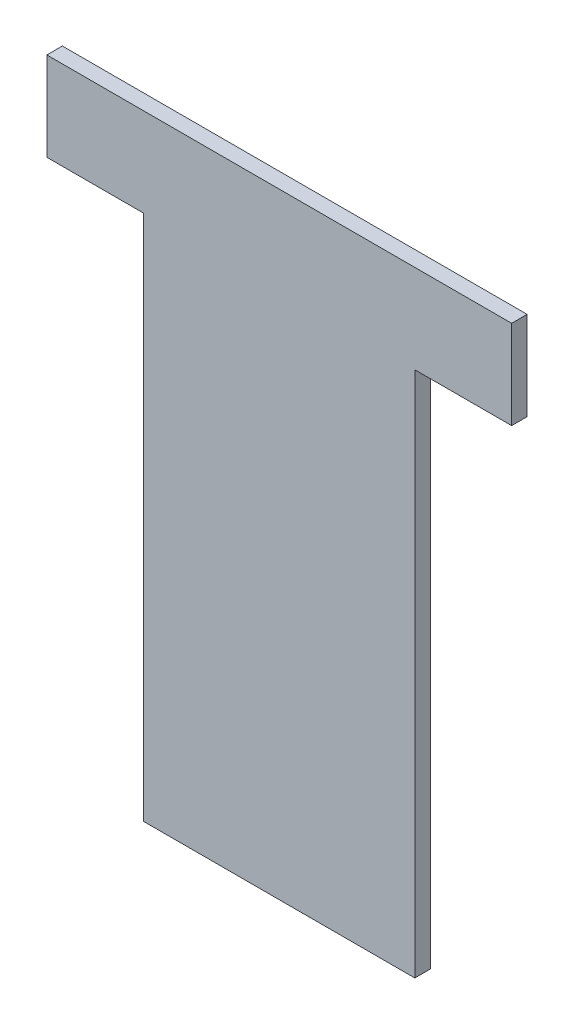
from build123d import *

# Parameters (mm, degrees)
SALIENTE_EXTRUIR1_DEPTH = 5


with BuildPart() as part:
    # Croquis1 → Saliente-Extruir1 (new body)
    with BuildSketch(Plane.XY):
        Polygon((-124.148712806, 115.046077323), (25.851287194, 115.046077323), (25.851287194, 86.436735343), (-5.398712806, 86.436735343), (-5.398712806, -83.563264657), (-92.898712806, -83.563264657), (-92.898712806, 86.436735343), (-124.148712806, 86.436735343), align=None)
    extrude(amount=SALIENTE_EXTRUIR1_DEPTH)


solid = part.part
